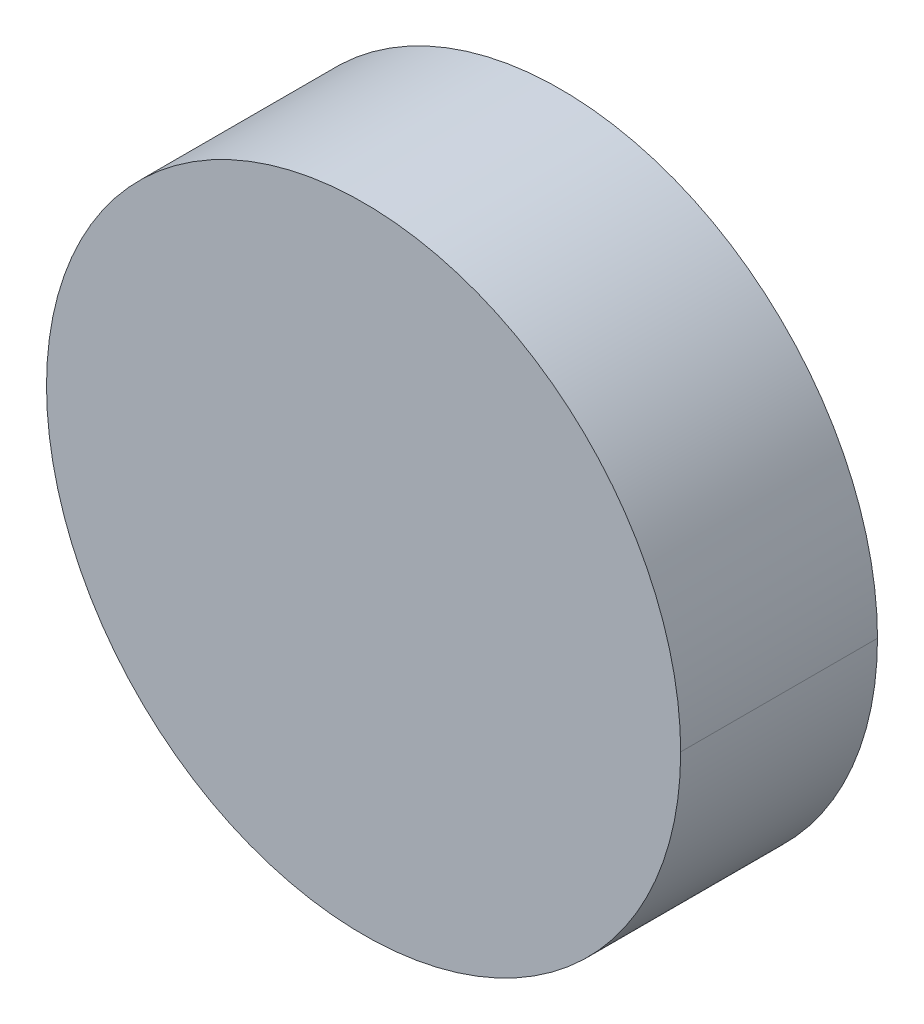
ISO-10303-21;
HEADER;
FILE_DESCRIPTION(('STEP AP214'),'2;1');
FILE_NAME('part.step','',(''),(''),'','','');
FILE_SCHEMA(('AUTOMOTIVE_DESIGN { 1 0 10303 214 1 1 1 1 }'));
ENDSEC;
DATA;
#1=APPLICATION_CONTEXT('core data for automotive mechanical design processes');
#2=APPLICATION_PROTOCOL_DEFINITION('international standard','automotive_design',2000,#1);
#3=PRODUCT_CONTEXT('',#1,'mechanical');
#4=PRODUCT('Part','Part','',(#3));
#5=PRODUCT_RELATED_PRODUCT_CATEGORY('part','',(#4));
#6=PRODUCT_DEFINITION_FORMATION('','',#4);
#7=PRODUCT_DEFINITION_CONTEXT('part definition',#1,'design');
#8=PRODUCT_DEFINITION('design','',#6,#7);
#9=PRODUCT_DEFINITION_SHAPE('','',#8);
#10=(LENGTH_UNIT() NAMED_UNIT(*) SI_UNIT(.MILLI.,.METRE.));
#11=(NAMED_UNIT(*) PLANE_ANGLE_UNIT() SI_UNIT($,.RADIAN.));
#12=(NAMED_UNIT(*) SI_UNIT($,.STERADIAN.) SOLID_ANGLE_UNIT());
#13=UNCERTAINTY_MEASURE_WITH_UNIT(LENGTH_MEASURE(1.E-05),#10,'distance_accuracy_value','');
#14=(GEOMETRIC_REPRESENTATION_CONTEXT(3) GLOBAL_UNCERTAINTY_ASSIGNED_CONTEXT((#13)) GLOBAL_UNIT_ASSIGNED_CONTEXT((#10,
#11,#12)) REPRESENTATION_CONTEXT('',''));
#15=CARTESIAN_POINT('',(0.,0.,0.));
#16=DIRECTION('',(0.,0.,1.));
#17=DIRECTION('',(1.,0.,0.));
#18=AXIS2_PLACEMENT_3D('',#15,#16,#17);
#19=CARTESIAN_POINT('',(14.8590000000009,0.,3.175));
#20=DIRECTION('',(0.,0.,-1.));
#21=DIRECTION('',(-1.,0.,0.));
#22=AXIS2_PLACEMENT_3D('',#19,#20,#21);
#23=PLANE('',#22);
#24=CARTESIAN_POINT('',(0.,0.,3.175));
#25=DIRECTION('',(0.,0.,1.));
#26=DIRECTION('',(1.,0.,0.));
#27=AXIS2_PLACEMENT_3D('',#24,#25,#26);
#28=CIRCLE('',#27,29.718);
#29=CARTESIAN_POINT('',(29.718,0.,3.175));
#30=VERTEX_POINT('',#29);
#31=CARTESIAN_POINT('',(-29.718,0.,3.175));
#32=VERTEX_POINT('',#31);
#33=EDGE_CURVE('E19',#30,#32,#28,.T.);
#34=ORIENTED_EDGE('',*,*,#33,.F.);
#35=CARTESIAN_POINT('',(0.,0.,3.175));
#36=DIRECTION('',(0.,0.,1.));
#37=DIRECTION('',(1.,0.,0.));
#38=AXIS2_PLACEMENT_3D('',#35,#36,#37);
#39=CIRCLE('',#38,29.718);
#40=EDGE_CURVE('E85',#32,#30,#39,.T.);
#41=ORIENTED_EDGE('',*,*,#40,.F.);
#42=EDGE_LOOP('',(#34,#41));
#43=FACE_BOUND('',#42,.T.);
#44=ADVANCED_FACE('F16',(#43),#23,.T.);
#45=CARTESIAN_POINT('',(0.,0.,0.657391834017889));
#46=DIRECTION('',(0.,0.,1.));
#47=DIRECTION('',(1.,0.,0.));
#48=AXIS2_PLACEMENT_3D('',#45,#46,#47);
#49=CYLINDRICAL_SURFACE('',#48,29.718);
#50=DIRECTION('',(0.,0.,1.));
#51=VECTOR('',#50,1.);
#52=CARTESIAN_POINT('',(-29.718,0.,1.9161959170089));
#53=LINE('',#52,#51);
#54=CARTESIAN_POINT('',(-29.7180000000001,0.,0.657391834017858));
#55=VERTEX_POINT('',#54);
#56=EDGE_CURVE('E74',#55,#32,#53,.T.);
#57=ORIENTED_EDGE('',*,*,#56,.F.);
#58=CARTESIAN_POINT('',(0.,0.,0.657391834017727));
#59=DIRECTION('',(0.,0.,1.));
#60=DIRECTION('',(1.,0.,0.));
#61=AXIS2_PLACEMENT_3D('',#58,#59,#60);
#62=CIRCLE('',#61,29.7180000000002);
#63=CARTESIAN_POINT('',(29.7180000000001,0.,0.657391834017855));
#64=VERTEX_POINT('',#63);
#65=EDGE_CURVE('E76',#64,#55,#62,.T.);
#66=ORIENTED_EDGE('',*,*,#65,.F.);
#67=DIRECTION('',(0.,0.,1.));
#68=VECTOR('',#67,1.);
#69=CARTESIAN_POINT('',(29.718,0.,1.9161959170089));
#70=LINE('',#69,#68);
#71=EDGE_CURVE('E79',#30,#64,#70,.F.);
#72=ORIENTED_EDGE('',*,*,#71,.F.);
#73=ORIENTED_EDGE('',*,*,#33,.T.);
#74=EDGE_LOOP('',(#57,#66,#72,#73));
#75=FACE_BOUND('',#74,.T.);
#76=ADVANCED_FACE('F78',(#75),#49,.F.);
#77=CARTESIAN_POINT('',(0.,0.,0.657391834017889));
#78=DIRECTION('',(0.,0.,1.));
#79=DIRECTION('',(1.,0.,0.));
#80=AXIS2_PLACEMENT_3D('',#77,#78,#79);
#81=CYLINDRICAL_SURFACE('',#80,29.718);
#82=ORIENTED_EDGE('',*,*,#56,.T.);
#83=ORIENTED_EDGE('',*,*,#40,.T.);
#84=ORIENTED_EDGE('',*,*,#71,.T.);
#85=CARTESIAN_POINT('',(0.,0.,0.6573918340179));
#86=DIRECTION('',(0.,0.,1.));
#87=DIRECTION('',(1.,0.,0.));
#88=AXIS2_PLACEMENT_3D('',#85,#86,#87);
#89=CIRCLE('',#88,29.7180000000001);
#90=EDGE_CURVE('E90',#55,#64,#89,.T.);
#91=ORIENTED_EDGE('',*,*,#90,.F.);
#92=EDGE_LOOP('',(#82,#83,#84,#91));
#93=FACE_BOUND('',#92,.T.);
#94=ADVANCED_FACE('F88',(#93),#81,.F.);
#95=CARTESIAN_POINT('',(-0.000426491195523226,0.,-23.8444554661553));
#96=DIRECTION('',(0.,-1.,0.));
#97=DIRECTION('',(1.,0.,0.));
#98=AXIS2_PLACEMENT_3D('',#95,#96,#97);
#99=CIRCLE('',#98,38.51656);
#100=TRIMMED_CURVE('',#99,(PARAMETER_VALUE(-1.5707852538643)),
(PARAMETER_VALUE(1.5707852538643)),.T.,.PARAMETER.);
#101=CARTESIAN_POINT('',(0.,0.,-23.8444554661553));
#102=DIRECTION('',(0.,0.,1.));
#103=AXIS1_PLACEMENT('',#101,#102);
#104=SURFACE_OF_REVOLUTION('',#100,#103);
#105=CARTESIAN_POINT('',(-0.000426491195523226,0.,-23.8444554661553));
#106=DIRECTION('',(0.,-1.,0.));
#107=DIRECTION('',(1.,0.,0.));
#108=AXIS2_PLACEMENT_3D('',#105,#106,#107);
#109=CIRCLE('',#108,38.51656);
#110=CARTESIAN_POINT('',(37.6826356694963,0.,-15.875));
#111=VERTEX_POINT('',#110);
#112=EDGE_CURVE('E94',#64,#111,#109,.F.);
#113=ORIENTED_EDGE('',*,*,#112,.F.);
#114=ORIENTED_EDGE('',*,*,#65,.T.);
#115=CARTESIAN_POINT('',(0.000426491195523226,0.,-23.8444554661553));
#116=DIRECTION('',(0.,1.,0.));
#117=DIRECTION('',(-1.,0.,0.));
#118=AXIS2_PLACEMENT_3D('',#115,#116,#117);
#119=CIRCLE('',#118,38.51656);
#120=CARTESIAN_POINT('',(-37.6826356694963,0.,-15.875));
#121=VERTEX_POINT('',#120);
#122=EDGE_CURVE('E84',#121,#55,#119,.T.);
#123=ORIENTED_EDGE('',*,*,#122,.F.);
#124=CARTESIAN_POINT('',(0.,0.,-15.875));
#125=DIRECTION('',(0.,0.,1.));
#126=DIRECTION('',(1.,0.,0.));
#127=AXIS2_PLACEMENT_3D('',#124,#125,#126);
#128=CIRCLE('',#127,37.6826356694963);
#129=EDGE_CURVE('E97',#111,#121,#128,.T.);
#130=ORIENTED_EDGE('',*,*,#129,.F.);
#131=EDGE_LOOP('',(#113,#114,#123,#130));
#132=FACE_BOUND('',#131,.T.);
#133=ADVANCED_FACE('F95',(#132),#104,.F.);
#134=CARTESIAN_POINT('',(-0.000426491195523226,0.,-23.8444554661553));
#135=DIRECTION('',(0.,-1.,0.));
#136=DIRECTION('',(1.,0.,0.));
#137=AXIS2_PLACEMENT_3D('',#134,#135,#136);
#138=CIRCLE('',#137,38.51656);
#139=TRIMMED_CURVE('',#138,(PARAMETER_VALUE(-1.5707852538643)),
(PARAMETER_VALUE(1.5707852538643)),.T.,.PARAMETER.);
#140=CARTESIAN_POINT('',(0.,0.,-23.8444554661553));
#141=DIRECTION('',(0.,0.,1.));
#142=AXIS1_PLACEMENT('',#140,#141);
#143=SURFACE_OF_REVOLUTION('',#139,#142);
#144=ORIENTED_EDGE('',*,*,#112,.T.);
#145=CARTESIAN_POINT('',(0.,0.,-15.875));
#146=DIRECTION('',(0.,0.,1.));
#147=DIRECTION('',(1.,0.,0.));
#148=AXIS2_PLACEMENT_3D('',#145,#146,#147);
#149=CIRCLE('',#148,37.6826356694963);
#150=EDGE_CURVE('E136',#121,#111,#149,.T.);
#151=ORIENTED_EDGE('',*,*,#150,.F.);
#152=ORIENTED_EDGE('',*,*,#122,.T.);
#153=ORIENTED_EDGE('',*,*,#90,.T.);
#154=EDGE_LOOP('',(#144,#151,#152,#153));
#155=FACE_BOUND('',#154,.T.);
#156=ADVANCED_FACE('F102',(#155),#143,.F.);
#157=CARTESIAN_POINT('',(38.8438178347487,0.,-15.875));
#158=DIRECTION('',(0.,0.,-1.));
#159=DIRECTION('',(-1.,0.,0.));
#160=AXIS2_PLACEMENT_3D('',#157,#158,#159);
#161=PLANE('',#160);
#162=ORIENTED_EDGE('',*,*,#129,.T.);
#163=ORIENTED_EDGE('',*,*,#150,.T.);
#164=EDGE_LOOP('',(#162,#163));
#165=FACE_BOUND('',#164,.T.);
#166=CARTESIAN_POINT('',(0.,0.,-15.875));
#167=DIRECTION('',(0.,0.,1.));
#168=DIRECTION('',(1.,0.,0.));
#169=AXIS2_PLACEMENT_3D('',#166,#167,#168);
#170=CIRCLE('',#169,40.0050000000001);
#171=CARTESIAN_POINT('',(40.0050000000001,0.,-15.875));
#172=VERTEX_POINT('',#171);
#173=CARTESIAN_POINT('',(-40.0050000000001,0.,-15.875));
#174=VERTEX_POINT('',#173);
#175=EDGE_CURVE('E133',#172,#174,#170,.T.);
#176=ORIENTED_EDGE('',*,*,#175,.F.);
#177=CARTESIAN_POINT('',(0.,0.,-15.875));
#178=DIRECTION('',(0.,0.,1.));
#179=DIRECTION('',(1.,0.,0.));
#180=AXIS2_PLACEMENT_3D('',#177,#178,#179);
#181=CIRCLE('',#180,40.0050000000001);
#182=EDGE_CURVE('E129',#174,#172,#181,.T.);
#183=ORIENTED_EDGE('',*,*,#182,.F.);
#184=EDGE_LOOP('',(#176,#183));
#185=FACE_BOUND('',#184,.T.);
#186=ADVANCED_FACE('F139',(#165,#185),#161,.T.);
#187=CARTESIAN_POINT('',(0.,0.,-14.2875));
#188=DIRECTION('',(0.,0.,1.));
#189=DIRECTION('',(1.,0.,0.));
#190=AXIS2_PLACEMENT_3D('',#187,#188,#189);
#191=CYLINDRICAL_SURFACE('',#190,40.0050000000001);
#192=DIRECTION('',(0.,0.,1.));
#193=VECTOR('',#192,1.);
#194=CARTESIAN_POINT('',(-40.0050000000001,0.,-14.2875));
#195=LINE('',#194,#193);
#196=CARTESIAN_POINT('',(-40.0050000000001,0.,-12.7));
#197=VERTEX_POINT('',#196);
#198=EDGE_CURVE('E132',#197,#174,#195,.F.);
#199=ORIENTED_EDGE('',*,*,#198,.F.);
#200=CARTESIAN_POINT('',(0.,0.,-12.7));
#201=DIRECTION('',(0.,0.,1.));
#202=DIRECTION('',(1.,0.,0.));
#203=AXIS2_PLACEMENT_3D('',#200,#201,#202);
#204=CIRCLE('',#203,40.0050000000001);
#205=CARTESIAN_POINT('',(40.0050000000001,0.,-12.7));
#206=VERTEX_POINT('',#205);
#207=EDGE_CURVE('E126',#206,#197,#204,.T.);
#208=ORIENTED_EDGE('',*,*,#207,.F.);
#209=DIRECTION('',(0.,0.,1.));
#210=VECTOR('',#209,1.);
#211=CARTESIAN_POINT('',(40.0050000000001,0.,-14.2875));
#212=LINE('',#211,#210);
#213=EDGE_CURVE('E135',#172,#206,#212,.T.);
#214=ORIENTED_EDGE('',*,*,#213,.F.);
#215=ORIENTED_EDGE('',*,*,#175,.T.);
#216=EDGE_LOOP('',(#199,#208,#214,#215));
#217=FACE_BOUND('',#216,.T.);
#218=ADVANCED_FACE('F142',(#217),#191,.T.);
#219=CARTESIAN_POINT('',(0.,0.,-14.2875));
#220=DIRECTION('',(0.,0.,1.));
#221=DIRECTION('',(1.,0.,0.));
#222=AXIS2_PLACEMENT_3D('',#219,#220,#221);
#223=CYLINDRICAL_SURFACE('',#222,40.0050000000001);
#224=ORIENTED_EDGE('',*,*,#198,.T.);
#225=ORIENTED_EDGE('',*,*,#182,.T.);
#226=ORIENTED_EDGE('',*,*,#213,.T.);
#227=CARTESIAN_POINT('',(0.,0.,-12.7));
#228=DIRECTION('',(0.,0.,1.));
#229=DIRECTION('',(1.,0.,0.));
#230=AXIS2_PLACEMENT_3D('',#227,#228,#229);
#231=CIRCLE('',#230,40.0050000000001);
#232=EDGE_CURVE('E123',#197,#206,#231,.T.);
#233=ORIENTED_EDGE('',*,*,#232,.F.);
#234=EDGE_LOOP('',(#224,#225,#226,#233));
#235=FACE_BOUND('',#234,.T.);
#236=ADVANCED_FACE('F152',(#235),#223,.T.);
#237=CARTESIAN_POINT('',(43.0212500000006,0.,-12.7));
#238=DIRECTION('',(0.,0.,-1.));
#239=DIRECTION('',(-1.,0.,0.));
#240=AXIS2_PLACEMENT_3D('',#237,#238,#239);
#241=PLANE('',#240);
#242=ORIENTED_EDGE('',*,*,#207,.T.);
#243=ORIENTED_EDGE('',*,*,#232,.T.);
#244=EDGE_LOOP('',(#242,#243));
#245=FACE_BOUND('',#244,.T.);
#246=CARTESIAN_POINT('',(0.,0.,-12.7));
#247=DIRECTION('',(0.,0.,1.));
#248=DIRECTION('',(1.,0.,0.));
#249=AXIS2_PLACEMENT_3D('',#246,#247,#248);
#250=CIRCLE('',#249,46.0375);
#251=CARTESIAN_POINT('',(46.0375,0.,-12.7));
#252=VERTEX_POINT('',#251);
#253=CARTESIAN_POINT('',(-46.0375,0.,-12.7));
#254=VERTEX_POINT('',#253);
#255=EDGE_CURVE('E120',#252,#254,#250,.T.);
#256=ORIENTED_EDGE('',*,*,#255,.F.);
#257=CARTESIAN_POINT('',(0.,0.,-12.7));
#258=DIRECTION('',(0.,0.,1.));
#259=DIRECTION('',(1.,0.,0.));
#260=AXIS2_PLACEMENT_3D('',#257,#258,#259);
#261=CIRCLE('',#260,46.0375);
#262=EDGE_CURVE('E117',#254,#252,#261,.T.);
#263=ORIENTED_EDGE('',*,*,#262,.F.);
#264=EDGE_LOOP('',(#256,#263));
#265=FACE_BOUND('',#264,.T.);
#266=ADVANCED_FACE('F189',(#245,#265),#241,.T.);
#267=CARTESIAN_POINT('',(0.,0.,1.5875));
#268=DIRECTION('',(0.,0.,1.));
#269=DIRECTION('',(1.,0.,0.));
#270=AXIS2_PLACEMENT_3D('',#267,#268,#269);
#271=CYLINDRICAL_SURFACE('',#270,46.0375);
#272=DIRECTION('',(0.,0.,1.));
#273=VECTOR('',#272,1.);
#274=CARTESIAN_POINT('',(-46.0375,0.,1.5875));
#275=LINE('',#274,#273);
#276=CARTESIAN_POINT('',(-46.0375,0.,15.875));
#277=VERTEX_POINT('',#276);
#278=EDGE_CURVE('E34',#277,#254,#275,.F.);
#279=ORIENTED_EDGE('',*,*,#278,.F.);
#280=CARTESIAN_POINT('',(0.,0.,15.875));
#281=DIRECTION('',(0.,0.,1.));
#282=DIRECTION('',(1.,0.,0.));
#283=AXIS2_PLACEMENT_3D('',#280,#281,#282);
#284=CIRCLE('',#283,46.0375);
#285=CARTESIAN_POINT('',(46.0375,0.,15.875));
#286=VERTEX_POINT('',#285);
#287=EDGE_CURVE('E25',#286,#277,#284,.T.);
#288=ORIENTED_EDGE('',*,*,#287,.F.);
#289=DIRECTION('',(0.,0.,1.));
#290=VECTOR('',#289,1.);
#291=CARTESIAN_POINT('',(46.0375,0.,1.5875));
#292=LINE('',#291,#290);
#293=EDGE_CURVE('E122',#252,#286,#292,.T.);
#294=ORIENTED_EDGE('',*,*,#293,.F.);
#295=ORIENTED_EDGE('',*,*,#255,.T.);
#296=EDGE_LOOP('',(#279,#288,#294,#295));
#297=FACE_BOUND('',#296,.T.);
#298=ADVANCED_FACE('F183',(#297),#271,.T.);
#299=CARTESIAN_POINT('',(0.,0.,1.5875));
#300=DIRECTION('',(0.,0.,1.));
#301=DIRECTION('',(1.,0.,0.));
#302=AXIS2_PLACEMENT_3D('',#299,#300,#301);
#303=CYLINDRICAL_SURFACE('',#302,46.0375);
#304=ORIENTED_EDGE('',*,*,#278,.T.);
#305=ORIENTED_EDGE('',*,*,#262,.T.);
#306=ORIENTED_EDGE('',*,*,#293,.T.);
#307=CARTESIAN_POINT('',(0.,0.,15.875));
#308=DIRECTION('',(0.,0.,1.));
#309=DIRECTION('',(1.,0.,0.));
#310=AXIS2_PLACEMENT_3D('',#307,#308,#309);
#311=CIRCLE('',#310,46.0375);
#312=EDGE_CURVE('E11',#277,#286,#311,.T.);
#313=ORIENTED_EDGE('',*,*,#312,.F.);
#314=EDGE_LOOP('',(#304,#305,#306,#313));
#315=FACE_BOUND('',#314,.T.);
#316=ADVANCED_FACE('F177',(#315),#303,.T.);
#317=CARTESIAN_POINT('',(23.01875,0.,15.875));
#318=DIRECTION('',(0.,0.,1.));
#319=DIRECTION('',(1.,0.,0.));
#320=AXIS2_PLACEMENT_3D('',#317,#318,#319);
#321=PLANE('',#320);
#322=ORIENTED_EDGE('',*,*,#287,.T.);
#323=ORIENTED_EDGE('',*,*,#312,.T.);
#324=EDGE_LOOP('',(#322,#323));
#325=FACE_BOUND('',#324,.T.);
#326=ADVANCED_FACE('F175',(#325),#321,.T.);
#327=CLOSED_SHELL('',(#44,#76,#94,#133,#156,#186,#218,#236,#266,#298,#316,#326));
#328=MANIFOLD_SOLID_BREP('B1',#327);
#329=ADVANCED_BREP_SHAPE_REPRESENTATION('',(#18,#328),#14);
#330=SHAPE_DEFINITION_REPRESENTATION(#9,#329);
ENDSEC;
END-ISO-10303-21;
